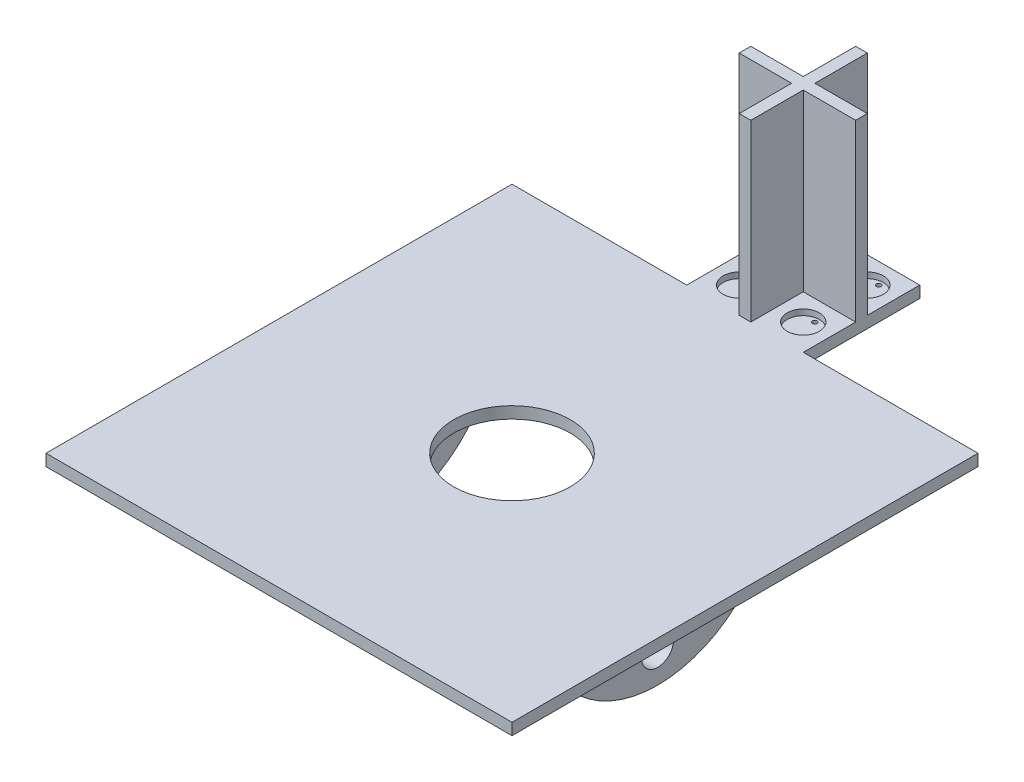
ISO-10303-21;
HEADER;
FILE_DESCRIPTION(('STEP AP214'),'2;1');
FILE_NAME('part.step','',(''),(''),'','','');
FILE_SCHEMA(('AUTOMOTIVE_DESIGN { 1 0 10303 214 1 1 1 1 }'));
ENDSEC;
DATA;
#1=APPLICATION_CONTEXT('core data for automotive mechanical design processes');
#2=APPLICATION_PROTOCOL_DEFINITION('international standard','automotive_design',2000,#1);
#3=PRODUCT_CONTEXT('',#1,'mechanical');
#4=PRODUCT('Part','Part','',(#3));
#5=PRODUCT_RELATED_PRODUCT_CATEGORY('part','',(#4));
#6=PRODUCT_DEFINITION_FORMATION('','',#4);
#7=PRODUCT_DEFINITION_CONTEXT('part definition',#1,'design');
#8=PRODUCT_DEFINITION('design','',#6,#7);
#9=PRODUCT_DEFINITION_SHAPE('','',#8);
#10=(LENGTH_UNIT() NAMED_UNIT(*) SI_UNIT(.MILLI.,.METRE.));
#11=(NAMED_UNIT(*) PLANE_ANGLE_UNIT() SI_UNIT($,.RADIAN.));
#12=(NAMED_UNIT(*) SI_UNIT($,.STERADIAN.) SOLID_ANGLE_UNIT());
#13=UNCERTAINTY_MEASURE_WITH_UNIT(LENGTH_MEASURE(1.E-05),#10,'distance_accuracy_value','');
#14=(GEOMETRIC_REPRESENTATION_CONTEXT(3) GLOBAL_UNCERTAINTY_ASSIGNED_CONTEXT((#13)) GLOBAL_UNIT_ASSIGNED_CONTEXT((#10,
#11,#12)) REPRESENTATION_CONTEXT('',''));
#15=CARTESIAN_POINT('',(0.,0.,0.));
#16=DIRECTION('',(0.,0.,1.));
#17=DIRECTION('',(1.,0.,0.));
#18=AXIS2_PLACEMENT_3D('',#15,#16,#17);
#19=CARTESIAN_POINT('',(22.05,-25.4,-25.4));
#20=DIRECTION('',(-1.,0.,0.));
#21=DIRECTION('',(0.,0.,1.));
#22=AXIS2_PLACEMENT_3D('',#19,#20,#21);
#23=PLANE('',#22);
#24=CARTESIAN_POINT('',(22.05,-18.5233102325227,-50.8));
#25=DIRECTION('',(-1.,0.,0.));
#26=DIRECTION('',(0.,0.,1.));
#27=AXIS2_PLACEMENT_3D('',#24,#25,#26);
#28=CIRCLE('',#27,3.5);
#29=CARTESIAN_POINT('',(22.05,-18.5233102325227,-47.3));
#30=VERTEX_POINT('',#29);
#31=EDGE_CURVE('E1110',#30,#30,#28,.T.);
#32=ORIENTED_EDGE('',*,*,#31,.T.);
#33=EDGE_LOOP('',(#32));
#34=FACE_BOUND('',#33,.T.);
#35=CARTESIAN_POINT('',(22.05,0.,-50.8));
#36=DIRECTION('',(-1.,0.,0.));
#37=DIRECTION('',(0.,0.,1.));
#38=AXIS2_PLACEMENT_3D('',#35,#36,#37);
#39=CIRCLE('',#38,25.4);
#40=CARTESIAN_POINT('',(22.05,0.,-76.2));
#41=VERTEX_POINT('',#40);
#42=CARTESIAN_POINT('',(22.05,0.,-25.4));
#43=VERTEX_POINT('',#42);
#44=EDGE_CURVE('E313',#41,#43,#39,.T.);
#45=ORIENTED_EDGE('',*,*,#44,.F.);
#46=DIRECTION('',(0.,0.,1.));
#47=VECTOR('',#46,1.);
#48=CARTESIAN_POINT('',(22.05,0.,-25.4));
#49=LINE('',#48,#47);
#50=EDGE_CURVE('E306',#41,#43,#49,.T.);
#51=ORIENTED_EDGE('',*,*,#50,.T.);
#52=EDGE_LOOP('',(#45,#51));
#53=FACE_BOUND('',#52,.T.);
#54=ADVANCED_FACE('F125',(#34,#53),#23,.F.);
#55=CARTESIAN_POINT('',(19.05,-25.4,-25.4));
#56=DIRECTION('',(1.,0.,0.));
#57=DIRECTION('',(0.,0.,-1.));
#58=AXIS2_PLACEMENT_3D('',#55,#56,#57);
#59=PLANE('',#58);
#60=CARTESIAN_POINT('',(19.05,-18.5233102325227,-50.8));
#61=DIRECTION('',(1.,0.,0.));
#62=DIRECTION('',(0.,0.,-1.));
#63=AXIS2_PLACEMENT_3D('',#60,#61,#62);
#64=CIRCLE('',#63,3.5);
#65=CARTESIAN_POINT('',(19.05,-18.5233102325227,-54.3));
#66=VERTEX_POINT('',#65);
#67=EDGE_CURVE('E1106',#66,#66,#64,.T.);
#68=ORIENTED_EDGE('',*,*,#67,.T.);
#69=EDGE_LOOP('',(#68));
#70=FACE_BOUND('',#69,.T.);
#71=DIRECTION('',(0.,0.,-1.));
#72=VECTOR('',#71,1.);
#73=CARTESIAN_POINT('',(19.05,0.,-25.4));
#74=LINE('',#73,#72);
#75=CARTESIAN_POINT('',(19.05,0.,-25.4));
#76=VERTEX_POINT('',#75);
#77=CARTESIAN_POINT('',(19.05,0.,-76.2));
#78=VERTEX_POINT('',#77);
#79=EDGE_CURVE('E329',#76,#78,#74,.T.);
#80=ORIENTED_EDGE('',*,*,#79,.T.);
#81=CARTESIAN_POINT('',(19.05,0.,-50.8));
#82=DIRECTION('',(1.,0.,0.));
#83=DIRECTION('',(0.,0.,-1.));
#84=AXIS2_PLACEMENT_3D('',#81,#82,#83);
#85=CIRCLE('',#84,25.4);
#86=EDGE_CURVE('E295',#76,#78,#85,.T.);
#87=ORIENTED_EDGE('',*,*,#86,.F.);
#88=EDGE_LOOP('',(#80,#87));
#89=FACE_BOUND('',#88,.T.);
#90=ADVANCED_FACE('F635',(#70,#89),#59,.F.);
#91=CARTESIAN_POINT('',(82.55,-25.4,-25.4));
#92=DIRECTION('',(-1.,0.,0.));
#93=DIRECTION('',(0.,0.,1.));
#94=AXIS2_PLACEMENT_3D('',#91,#92,#93);
#95=PLANE('',#94);
#96=CARTESIAN_POINT('',(82.55,-7.5233102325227,-50.8));
#97=DIRECTION('',(1.,0.,0.));
#98=DIRECTION('',(0.,0.,-1.));
#99=AXIS2_PLACEMENT_3D('',#96,#97,#98);
#100=CIRCLE('',#99,0.749999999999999);
#101=CARTESIAN_POINT('',(82.55,-7.5233102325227,-51.55));
#102=VERTEX_POINT('',#101);
#103=EDGE_CURVE('E1098',#102,#102,#100,.T.);
#104=ORIENTED_EDGE('',*,*,#103,.F.);
#105=EDGE_LOOP('',(#104));
#106=FACE_BOUND('',#105,.T.);
#107=CARTESIAN_POINT('',(82.55,-18.5233102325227,-50.8));
#108=DIRECTION('',(-1.,0.,0.));
#109=DIRECTION('',(0.,0.,1.));
#110=AXIS2_PLACEMENT_3D('',#107,#108,#109);
#111=CIRCLE('',#110,3.5);
#112=CARTESIAN_POINT('',(82.55,-18.5233102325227,-47.3));
#113=VERTEX_POINT('',#112);
#114=EDGE_CURVE('E1102',#113,#113,#111,.T.);
#115=ORIENTED_EDGE('',*,*,#114,.T.);
#116=EDGE_LOOP('',(#115));
#117=FACE_BOUND('',#116,.T.);
#118=CARTESIAN_POINT('',(82.55,0.,-50.8));
#119=DIRECTION('',(-1.,0.,0.));
#120=DIRECTION('',(0.,0.,1.));
#121=AXIS2_PLACEMENT_3D('',#118,#119,#120);
#122=CIRCLE('',#121,25.4);
#123=CARTESIAN_POINT('',(82.55,0.,-76.2));
#124=VERTEX_POINT('',#123);
#125=CARTESIAN_POINT('',(82.55,0.,-25.4));
#126=VERTEX_POINT('',#125);
#127=EDGE_CURVE('E287',#124,#126,#122,.T.);
#128=ORIENTED_EDGE('',*,*,#127,.F.);
#129=DIRECTION('',(0.,0.,1.));
#130=VECTOR('',#129,1.);
#131=CARTESIAN_POINT('',(82.55,0.,-25.4));
#132=LINE('',#131,#130);
#133=EDGE_CURVE('E291',#124,#126,#132,.T.);
#134=ORIENTED_EDGE('',*,*,#133,.T.);
#135=EDGE_LOOP('',(#128,#134));
#136=FACE_BOUND('',#135,.T.);
#137=ADVANCED_FACE('F289',(#106,#117,#136),#95,.F.);
#138=CARTESIAN_POINT('',(79.55,-25.4,-25.4));
#139=DIRECTION('',(1.,0.,0.));
#140=DIRECTION('',(0.,0.,-1.));
#141=AXIS2_PLACEMENT_3D('',#138,#139,#140);
#142=PLANE('',#141);
#143=CARTESIAN_POINT('',(79.55,-7.5233102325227,-50.8));
#144=DIRECTION('',(1.,0.,0.));
#145=DIRECTION('',(0.,0.,-1.));
#146=AXIS2_PLACEMENT_3D('',#143,#144,#145);
#147=CIRCLE('',#146,0.749999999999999);
#148=CARTESIAN_POINT('',(79.55,-7.5233102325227,-51.55));
#149=VERTEX_POINT('',#148);
#150=EDGE_CURVE('E1088',#149,#149,#147,.F.);
#151=ORIENTED_EDGE('',*,*,#150,.F.);
#152=EDGE_LOOP('',(#151));
#153=FACE_BOUND('',#152,.T.);
#154=CARTESIAN_POINT('',(79.55,-18.5233102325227,-50.8));
#155=DIRECTION('',(1.,0.,0.));
#156=DIRECTION('',(0.,0.,-1.));
#157=AXIS2_PLACEMENT_3D('',#154,#155,#156);
#158=CIRCLE('',#157,3.5);
#159=CARTESIAN_POINT('',(79.55,-18.5233102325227,-54.3));
#160=VERTEX_POINT('',#159);
#161=EDGE_CURVE('E129',#160,#160,#158,.T.);
#162=ORIENTED_EDGE('',*,*,#161,.T.);
#163=EDGE_LOOP('',(#162));
#164=FACE_BOUND('',#163,.T.);
#165=DIRECTION('',(0.,0.,-1.));
#166=VECTOR('',#165,1.);
#167=CARTESIAN_POINT('',(79.55,0.,-25.4));
#168=LINE('',#167,#166);
#169=CARTESIAN_POINT('',(79.55,0.,-25.4));
#170=VERTEX_POINT('',#169);
#171=CARTESIAN_POINT('',(79.55,0.,-76.2));
#172=VERTEX_POINT('',#171);
#173=EDGE_CURVE('E307',#170,#172,#168,.T.);
#174=ORIENTED_EDGE('',*,*,#173,.T.);
#175=CARTESIAN_POINT('',(79.55,0.,-50.8));
#176=DIRECTION('',(1.,0.,0.));
#177=DIRECTION('',(0.,0.,-1.));
#178=AXIS2_PLACEMENT_3D('',#175,#176,#177);
#179=CIRCLE('',#178,25.4);
#180=EDGE_CURVE('E296',#170,#172,#179,.T.);
#181=ORIENTED_EDGE('',*,*,#180,.F.);
#182=EDGE_LOOP('',(#174,#181));
#183=FACE_BOUND('',#182,.T.);
#184=ADVANCED_FACE('F678',(#153,#164,#183),#142,.F.);
#185=CARTESIAN_POINT('',(0.,0.,0.));
#186=DIRECTION('',(0.,-1.,0.));
#187=DIRECTION('',(0.,0.,-1.));
#188=AXIS2_PLACEMENT_3D('',#185,#186,#187);
#189=PLANE('',#188);
#190=CARTESIAN_POINT('',(43.815,0.,-104.815));
#191=DIRECTION('',(0.,1.,0.));
#192=DIRECTION('',(0.,0.,1.));
#193=AXIS2_PLACEMENT_3D('',#190,#191,#192);
#194=CIRCLE('',#193,0.499999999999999);
#195=CARTESIAN_POINT('',(43.815,0.,-104.315));
#196=VERTEX_POINT('',#195);
#197=EDGE_CURVE('E1189',#196,#196,#194,.T.);
#198=ORIENTED_EDGE('',*,*,#197,.T.);
#199=EDGE_LOOP('',(#198));
#200=FACE_BOUND('',#199,.T.);
#201=CARTESIAN_POINT('',(43.815,0.,-109.815));
#202=DIRECTION('',(0.,1.,0.));
#203=DIRECTION('',(0.,0.,1.));
#204=AXIS2_PLACEMENT_3D('',#201,#202,#203);
#205=CIRCLE('',#204,0.499999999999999);
#206=CARTESIAN_POINT('',(43.815,0.,-109.315));
#207=VERTEX_POINT('',#206);
#208=EDGE_CURVE('E1181',#207,#207,#205,.T.);
#209=ORIENTED_EDGE('',*,*,#208,.T.);
#210=EDGE_LOOP('',(#209));
#211=FACE_BOUND('',#210,.T.);
#212=CARTESIAN_POINT('',(57.785,0.,-109.815));
#213=DIRECTION('',(0.,1.,0.));
#214=DIRECTION('',(0.,0.,1.));
#215=AXIS2_PLACEMENT_3D('',#212,#213,#214);
#216=CIRCLE('',#215,0.499999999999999);
#217=CARTESIAN_POINT('',(57.785,0.,-109.315));
#218=VERTEX_POINT('',#217);
#219=EDGE_CURVE('E1173',#218,#218,#216,.T.);
#220=ORIENTED_EDGE('',*,*,#219,.T.);
#221=EDGE_LOOP('',(#220));
#222=FACE_BOUND('',#221,.T.);
#223=CARTESIAN_POINT('',(57.785,0.,-118.785));
#224=DIRECTION('',(0.,1.,0.));
#225=DIRECTION('',(0.,0.,1.));
#226=AXIS2_PLACEMENT_3D('',#223,#224,#225);
#227=CIRCLE('',#226,0.499999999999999);
#228=CARTESIAN_POINT('',(57.785,0.,-118.285));
#229=VERTEX_POINT('',#228);
#230=EDGE_CURVE('E1164',#229,#229,#227,.T.);
#231=ORIENTED_EDGE('',*,*,#230,.T.);
#232=EDGE_LOOP('',(#231));
#233=FACE_BOUND('',#232,.T.);
#234=CARTESIAN_POINT('',(57.785,0.,-123.785));
#235=DIRECTION('',(0.,1.,0.));
#236=DIRECTION('',(0.,0.,1.));
#237=AXIS2_PLACEMENT_3D('',#234,#235,#236);
#238=CIRCLE('',#237,0.499999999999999);
#239=CARTESIAN_POINT('',(57.785,0.,-123.285));
#240=VERTEX_POINT('',#239);
#241=EDGE_CURVE('E1212',#240,#240,#238,.T.);
#242=ORIENTED_EDGE('',*,*,#241,.T.);
#243=EDGE_LOOP('',(#242));
#244=FACE_BOUND('',#243,.T.);
#245=CARTESIAN_POINT('',(43.815,0.,-123.785));
#246=DIRECTION('',(0.,1.,0.));
#247=DIRECTION('',(0.,0.,1.));
#248=AXIS2_PLACEMENT_3D('',#245,#246,#247);
#249=CIRCLE('',#248,0.499999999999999);
#250=CARTESIAN_POINT('',(43.815,0.,-123.285));
#251=VERTEX_POINT('',#250);
#252=EDGE_CURVE('E1204',#251,#251,#249,.T.);
#253=ORIENTED_EDGE('',*,*,#252,.T.);
#254=EDGE_LOOP('',(#253));
#255=FACE_BOUND('',#254,.T.);
#256=CARTESIAN_POINT('',(57.785,0.,-104.815));
#257=DIRECTION('',(0.,1.,0.));
#258=DIRECTION('',(0.,0.,1.));
#259=AXIS2_PLACEMENT_3D('',#256,#257,#258);
#260=CIRCLE('',#259,0.499999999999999);
#261=CARTESIAN_POINT('',(57.785,0.,-104.315));
#262=VERTEX_POINT('',#261);
#263=EDGE_CURVE('E1196',#262,#262,#260,.T.);
#264=ORIENTED_EDGE('',*,*,#263,.T.);
#265=EDGE_LOOP('',(#264));
#266=FACE_BOUND('',#265,.T.);
#267=CARTESIAN_POINT('',(43.815,0.,-118.785));
#268=DIRECTION('',(0.,1.,0.));
#269=DIRECTION('',(0.,0.,1.));
#270=AXIS2_PLACEMENT_3D('',#267,#268,#269);
#271=CIRCLE('',#270,0.499999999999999);
#272=CARTESIAN_POINT('',(43.815,0.,-118.285));
#273=VERTEX_POINT('',#272);
#274=EDGE_CURVE('E1141',#273,#273,#271,.T.);
#275=ORIENTED_EDGE('',*,*,#274,.T.);
#276=EDGE_LOOP('',(#275));
#277=FACE_BOUND('',#276,.T.);
#278=DIRECTION('',(1.,0.,0.));
#279=VECTOR('',#278,1.);
#280=CARTESIAN_POINT('',(22.05,0.,-76.2));
#281=LINE('',#280,#279);
#282=EDGE_CURVE('E333',#78,#41,#281,.T.);
#283=ORIENTED_EDGE('',*,*,#282,.F.);
#284=ORIENTED_EDGE('',*,*,#79,.F.);
#285=DIRECTION('',(-1.,0.,0.));
#286=VECTOR('',#285,1.);
#287=CARTESIAN_POINT('',(22.05,0.,-25.4));
#288=LINE('',#287,#286);
#289=EDGE_CURVE('E326',#43,#76,#288,.T.);
#290=ORIENTED_EDGE('',*,*,#289,.F.);
#291=ORIENTED_EDGE('',*,*,#50,.F.);
#292=EDGE_LOOP('',(#283,#284,#290,#291));
#293=FACE_BOUND('',#292,.T.);
#294=DIRECTION('',(1.,0.,0.));
#295=VECTOR('',#294,1.);
#296=CARTESIAN_POINT('',(82.55,0.,-76.2));
#297=LINE('',#296,#295);
#298=EDGE_CURVE('E299',#172,#124,#297,.T.);
#299=ORIENTED_EDGE('',*,*,#298,.F.);
#300=ORIENTED_EDGE('',*,*,#173,.F.);
#301=DIRECTION('',(-1.,0.,0.));
#302=VECTOR('',#301,1.);
#303=CARTESIAN_POINT('',(82.55,0.,-25.4));
#304=LINE('',#303,#302);
#305=EDGE_CURVE('E311',#126,#170,#304,.T.);
#306=ORIENTED_EDGE('',*,*,#305,.F.);
#307=ORIENTED_EDGE('',*,*,#133,.F.);
#308=EDGE_LOOP('',(#299,#300,#306,#307));
#309=FACE_BOUND('',#308,.T.);
#310=DIRECTION('',(1.,0.,0.));
#311=VECTOR('',#310,1.);
#312=CARTESIAN_POINT('',(0.,0.,0.));
#313=LINE('',#312,#311);
#314=CARTESIAN_POINT('',(0.,0.,0.));
#315=VERTEX_POINT('',#314);
#316=CARTESIAN_POINT('',(101.6,0.,0.));
#317=VERTEX_POINT('',#316);
#318=EDGE_CURVE('E493',#315,#317,#313,.T.);
#319=ORIENTED_EDGE('',*,*,#318,.F.);
#320=DIRECTION('',(0.,0.,1.));
#321=VECTOR('',#320,1.);
#322=CARTESIAN_POINT('',(0.,0.,0.));
#323=LINE('',#322,#321);
#324=CARTESIAN_POINT('',(0.,0.,-101.6));
#325=VERTEX_POINT('',#324);
#326=EDGE_CURVE('E457',#325,#315,#323,.T.);
#327=ORIENTED_EDGE('',*,*,#326,.F.);
#328=DIRECTION('',(-1.,0.,0.));
#329=VECTOR('',#328,1.);
#330=CARTESIAN_POINT('',(0.,0.,-101.6));
#331=LINE('',#330,#329);
#332=CARTESIAN_POINT('',(38.1,0.,-101.6));
#333=VERTEX_POINT('',#332);
#334=EDGE_CURVE('E466',#333,#325,#331,.T.);
#335=ORIENTED_EDGE('',*,*,#334,.F.);
#336=DIRECTION('',(0.,0.,1.));
#337=VECTOR('',#336,1.);
#338=CARTESIAN_POINT('',(38.1,0.,-101.6));
#339=LINE('',#338,#337);
#340=CARTESIAN_POINT('',(38.1,0.,-127.));
#341=VERTEX_POINT('',#340);
#342=EDGE_CURVE('E508',#341,#333,#339,.T.);
#343=ORIENTED_EDGE('',*,*,#342,.F.);
#344=DIRECTION('',(-1.,0.,0.));
#345=VECTOR('',#344,1.);
#346=CARTESIAN_POINT('',(38.1,0.,-127.));
#347=LINE('',#346,#345);
#348=CARTESIAN_POINT('',(63.5,0.,-127.));
#349=VERTEX_POINT('',#348);
#350=EDGE_CURVE('E505',#349,#341,#347,.T.);
#351=ORIENTED_EDGE('',*,*,#350,.F.);
#352=DIRECTION('',(0.,0.,-1.));
#353=VECTOR('',#352,1.);
#354=CARTESIAN_POINT('',(63.5,0.,-101.6));
#355=LINE('',#354,#353);
#356=CARTESIAN_POINT('',(63.5,0.,-101.6));
#357=VERTEX_POINT('',#356);
#358=EDGE_CURVE('E502',#357,#349,#355,.T.);
#359=ORIENTED_EDGE('',*,*,#358,.F.);
#360=DIRECTION('',(-1.,0.,0.));
#361=VECTOR('',#360,1.);
#362=CARTESIAN_POINT('',(63.5,0.,-101.6));
#363=LINE('',#362,#361);
#364=CARTESIAN_POINT('',(101.6,0.,-101.6));
#365=VERTEX_POINT('',#364);
#366=EDGE_CURVE('E499',#365,#357,#363,.T.);
#367=ORIENTED_EDGE('',*,*,#366,.F.);
#368=DIRECTION('',(0.,0.,-1.));
#369=VECTOR('',#368,1.);
#370=CARTESIAN_POINT('',(101.6,0.,0.));
#371=LINE('',#370,#369);
#372=EDGE_CURVE('E496',#317,#365,#371,.T.);
#373=ORIENTED_EDGE('',*,*,#372,.F.);
#374=EDGE_LOOP('',(#319,#327,#335,#343,#351,#359,#367,#373));
#375=FACE_BOUND('',#374,.T.);
#376=CARTESIAN_POINT('',(50.8,0.,-50.8));
#377=DIRECTION('',(0.,1.,0.));
#378=DIRECTION('',(0.,0.,1.));
#379=AXIS2_PLACEMENT_3D('',#376,#377,#378);
#380=CIRCLE('',#379,12.7);
#381=CARTESIAN_POINT('',(50.8,0.,-38.1));
#382=VERTEX_POINT('',#381);
#383=EDGE_CURVE('E452',#382,#382,#380,.T.);
#384=ORIENTED_EDGE('',*,*,#383,.T.);
#385=EDGE_LOOP('',(#384));
#386=FACE_BOUND('',#385,.T.);
#387=ADVANCED_FACE('F309',(#200,#211,#222,#233,#244,#255,#266,#277,#293,#309,#375,#386),#189,.T.);
#388=CARTESIAN_POINT('',(0.,2.54,0.));
#389=DIRECTION('',(0.,-1.,0.));
#390=DIRECTION('',(0.,0.,-1.));
#391=AXIS2_PLACEMENT_3D('',#388,#389,#390);
#392=PLANE('',#391);
#393=CARTESIAN_POINT('',(57.785,2.54,-121.285));
#394=DIRECTION('',(0.,1.,0.));
#395=DIRECTION('',(0.,0.,1.));
#396=AXIS2_PLACEMENT_3D('',#393,#394,#395);
#397=CIRCLE('',#396,3.5);
#398=CARTESIAN_POINT('',(57.785,2.54,-117.785));
#399=VERTEX_POINT('',#398);
#400=EDGE_CURVE('E1136',#399,#399,#397,.T.);
#401=ORIENTED_EDGE('',*,*,#400,.F.);
#402=EDGE_LOOP('',(#401));
#403=FACE_BOUND('',#402,.T.);
#404=DIRECTION('',(0.,0.,-1.));
#405=VECTOR('',#404,1.);
#406=CARTESIAN_POINT('',(52.07,2.54,-127.));
#407=LINE('',#406,#405);
#408=CARTESIAN_POINT('',(52.07,2.54,-115.57));
#409=VERTEX_POINT('',#408);
#410=CARTESIAN_POINT('',(52.07,2.54,-127.));
#411=VERTEX_POINT('',#410);
#412=EDGE_CURVE('E142',#409,#411,#407,.T.);
#413=ORIENTED_EDGE('',*,*,#412,.F.);
#414=DIRECTION('',(-1.,0.,0.));
#415=VECTOR('',#414,1.);
#416=CARTESIAN_POINT('',(52.07,2.54,-115.57));
#417=LINE('',#416,#415);
#418=CARTESIAN_POINT('',(63.5,2.54,-115.57));
#419=VERTEX_POINT('',#418);
#420=EDGE_CURVE('E400',#419,#409,#417,.T.);
#421=ORIENTED_EDGE('',*,*,#420,.F.);
#422=DIRECTION('',(0.,0.,-1.));
#423=VECTOR('',#422,1.);
#424=CARTESIAN_POINT('',(63.5,2.54,-101.6));
#425=LINE('',#424,#423);
#426=CARTESIAN_POINT('',(63.5,2.54,-127.));
#427=VERTEX_POINT('',#426);
#428=EDGE_CURVE('E475',#419,#427,#425,.T.);
#429=ORIENTED_EDGE('',*,*,#428,.T.);
#430=DIRECTION('',(-1.,0.,0.));
#431=VECTOR('',#430,1.);
#432=CARTESIAN_POINT('',(38.1,2.54,-127.));
#433=LINE('',#432,#431);
#434=EDGE_CURVE('E480',#427,#411,#433,.T.);
#435=ORIENTED_EDGE('',*,*,#434,.T.);
#436=EDGE_LOOP('',(#413,#421,#429,#435));
#437=FACE_BOUND('',#436,.T.);
#438=ADVANCED_FACE('F592',(#403,#437),#392,.F.);
#439=CARTESIAN_POINT('',(57.785,2.54,-107.315));
#440=DIRECTION('',(0.,1.,0.));
#441=DIRECTION('',(0.,0.,1.));
#442=AXIS2_PLACEMENT_3D('',#439,#440,#441);
#443=CIRCLE('',#442,3.5);
#444=CARTESIAN_POINT('',(57.785,2.54,-103.815));
#445=VERTEX_POINT('',#444);
#446=EDGE_CURVE('E1145',#445,#445,#443,.T.);
#447=ORIENTED_EDGE('',*,*,#446,.F.);
#448=EDGE_LOOP('',(#447));
#449=FACE_BOUND('',#448,.T.);
#450=CARTESIAN_POINT('',(43.815,2.54,-107.315));
#451=DIRECTION('',(0.,1.,0.));
#452=DIRECTION('',(0.,0.,1.));
#453=AXIS2_PLACEMENT_3D('',#450,#451,#452);
#454=CIRCLE('',#453,3.5);
#455=CARTESIAN_POINT('',(43.815,2.54,-103.815));
#456=VERTEX_POINT('',#455);
#457=EDGE_CURVE('E1091',#456,#456,#454,.T.);
#458=ORIENTED_EDGE('',*,*,#457,.F.);
#459=EDGE_LOOP('',(#458));
#460=FACE_BOUND('',#459,.T.);
#461=CARTESIAN_POINT('',(50.8,2.54,-50.8));
#462=DIRECTION('',(0.,1.,0.));
#463=DIRECTION('',(0.,0.,1.));
#464=AXIS2_PLACEMENT_3D('',#461,#462,#463);
#465=CIRCLE('',#464,12.7);
#466=CARTESIAN_POINT('',(50.8,2.54,-38.1));
#467=VERTEX_POINT('',#466);
#468=EDGE_CURVE('E453',#467,#467,#465,.T.);
#469=ORIENTED_EDGE('',*,*,#468,.F.);
#470=EDGE_LOOP('',(#469));
#471=FACE_BOUND('',#470,.T.);
#472=DIRECTION('',(1.,0.,0.));
#473=VECTOR('',#472,1.);
#474=CARTESIAN_POINT('',(63.5,2.54,-113.03));
#475=LINE('',#474,#473);
#476=CARTESIAN_POINT('',(52.07,2.54,-113.03));
#477=VERTEX_POINT('',#476);
#478=CARTESIAN_POINT('',(63.5,2.54,-113.03));
#479=VERTEX_POINT('',#478);
#480=EDGE_CURVE('E150',#477,#479,#475,.T.);
#481=ORIENTED_EDGE('',*,*,#480,.F.);
#482=DIRECTION('',(0.,0.,-1.));
#483=VECTOR('',#482,1.);
#484=CARTESIAN_POINT('',(52.07,2.54,-113.03));
#485=LINE('',#484,#483);
#486=CARTESIAN_POINT('',(52.0700000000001,2.54,-101.6));
#487=VERTEX_POINT('',#486);
#488=EDGE_CURVE('E395',#487,#477,#485,.T.);
#489=ORIENTED_EDGE('',*,*,#488,.F.);
#490=DIRECTION('',(1.,0.,0.));
#491=VECTOR('',#490,1.);
#492=CARTESIAN_POINT('',(52.0700000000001,2.54,-101.6));
#493=LINE('',#492,#491);
#494=CARTESIAN_POINT('',(49.53,2.54,-101.6));
#495=VERTEX_POINT('',#494);
#496=EDGE_CURVE('E391',#495,#487,#493,.T.);
#497=ORIENTED_EDGE('',*,*,#496,.F.);
#498=DIRECTION('',(0.,0.,1.));
#499=VECTOR('',#498,1.);
#500=CARTESIAN_POINT('',(49.53,2.54,-101.6));
#501=LINE('',#500,#499);
#502=CARTESIAN_POINT('',(49.53,2.54,-113.03));
#503=VERTEX_POINT('',#502);
#504=EDGE_CURVE('E387',#503,#495,#501,.T.);
#505=ORIENTED_EDGE('',*,*,#504,.F.);
#506=DIRECTION('',(1.,0.,0.));
#507=VECTOR('',#506,1.);
#508=CARTESIAN_POINT('',(49.53,2.54,-113.03));
#509=LINE('',#508,#507);
#510=CARTESIAN_POINT('',(38.1,2.54,-113.03));
#511=VERTEX_POINT('',#510);
#512=EDGE_CURVE('E383',#511,#503,#509,.T.);
#513=ORIENTED_EDGE('',*,*,#512,.F.);
#514=DIRECTION('',(0.,0.,1.));
#515=VECTOR('',#514,1.);
#516=CARTESIAN_POINT('',(38.1,2.54,-101.6));
#517=LINE('',#516,#515);
#518=CARTESIAN_POINT('',(38.1,2.54,-101.6));
#519=VERTEX_POINT('',#518);
#520=EDGE_CURVE('E483',#511,#519,#517,.T.);
#521=ORIENTED_EDGE('',*,*,#520,.T.);
#522=DIRECTION('',(-1.,0.,0.));
#523=VECTOR('',#522,1.);
#524=CARTESIAN_POINT('',(0.,2.54,-101.6));
#525=LINE('',#524,#523);
#526=CARTESIAN_POINT('',(0.,2.54,-101.6));
#527=VERTEX_POINT('',#526);
#528=EDGE_CURVE('E487',#519,#527,#525,.T.);
#529=ORIENTED_EDGE('',*,*,#528,.T.);
#530=DIRECTION('',(0.,0.,1.));
#531=VECTOR('',#530,1.);
#532=CARTESIAN_POINT('',(0.,2.54,0.));
#533=LINE('',#532,#531);
#534=CARTESIAN_POINT('',(0.,2.54,0.));
#535=VERTEX_POINT('',#534);
#536=EDGE_CURVE('E461',#527,#535,#533,.T.);
#537=ORIENTED_EDGE('',*,*,#536,.T.);
#538=DIRECTION('',(1.,0.,0.));
#539=VECTOR('',#538,1.);
#540=CARTESIAN_POINT('',(0.,2.54,0.));
#541=LINE('',#540,#539);
#542=CARTESIAN_POINT('',(101.6,2.54,0.));
#543=VERTEX_POINT('',#542);
#544=EDGE_CURVE('E465',#535,#543,#541,.T.);
#545=ORIENTED_EDGE('',*,*,#544,.T.);
#546=DIRECTION('',(0.,0.,-1.));
#547=VECTOR('',#546,1.);
#548=CARTESIAN_POINT('',(101.6,2.54,0.));
#549=LINE('',#548,#547);
#550=CARTESIAN_POINT('',(101.6,2.54,-101.6));
#551=VERTEX_POINT('',#550);
#552=EDGE_CURVE('E469',#543,#551,#549,.T.);
#553=ORIENTED_EDGE('',*,*,#552,.T.);
#554=DIRECTION('',(-1.,0.,0.));
#555=VECTOR('',#554,1.);
#556=CARTESIAN_POINT('',(63.5,2.54,-101.6));
#557=LINE('',#556,#555);
#558=CARTESIAN_POINT('',(63.5,2.54,-101.6));
#559=VERTEX_POINT('',#558);
#560=EDGE_CURVE('E472',#551,#559,#557,.T.);
#561=ORIENTED_EDGE('',*,*,#560,.T.);
#562=EDGE_CURVE('E476',#559,#479,#425,.T.);
#563=ORIENTED_EDGE('',*,*,#562,.T.);
#564=EDGE_LOOP('',(#481,#489,#497,#505,#513,#521,#529,#537,#545,#553,#561,#563));
#565=FACE_BOUND('',#564,.T.);
#566=ADVANCED_FACE('F561',(#449,#460,#471,#565),#392,.F.);
#567=CARTESIAN_POINT('',(43.815,2.54,-121.285));
#568=DIRECTION('',(0.,1.,0.));
#569=DIRECTION('',(0.,0.,1.));
#570=AXIS2_PLACEMENT_3D('',#567,#568,#569);
#571=CIRCLE('',#570,3.5);
#572=CARTESIAN_POINT('',(43.815,2.54,-117.785));
#573=VERTEX_POINT('',#572);
#574=EDGE_CURVE('E1079',#573,#573,#571,.T.);
#575=ORIENTED_EDGE('',*,*,#574,.F.);
#576=EDGE_LOOP('',(#575));
#577=FACE_BOUND('',#576,.T.);
#578=DIRECTION('',(0.,0.,1.));
#579=VECTOR('',#578,1.);
#580=CARTESIAN_POINT('',(49.53,2.54,-115.57));
#581=LINE('',#580,#579);
#582=CARTESIAN_POINT('',(49.53,2.54,-127.));
#583=VERTEX_POINT('',#582);
#584=CARTESIAN_POINT('',(49.53,2.54,-115.57));
#585=VERTEX_POINT('',#584);
#586=EDGE_CURVE('E337',#583,#585,#581,.T.);
#587=ORIENTED_EDGE('',*,*,#586,.F.);
#588=CARTESIAN_POINT('',(38.1,2.54,-127.));
#589=VERTEX_POINT('',#588);
#590=EDGE_CURVE('E479',#583,#589,#433,.T.);
#591=ORIENTED_EDGE('',*,*,#590,.T.);
#592=CARTESIAN_POINT('',(38.1,2.54,-115.57));
#593=VERTEX_POINT('',#592);
#594=EDGE_CURVE('E484',#589,#593,#517,.T.);
#595=ORIENTED_EDGE('',*,*,#594,.T.);
#596=DIRECTION('',(-1.,0.,0.));
#597=VECTOR('',#596,1.);
#598=CARTESIAN_POINT('',(38.1,2.54,-115.57));
#599=LINE('',#598,#597);
#600=EDGE_CURVE('E379',#585,#593,#599,.T.);
#601=ORIENTED_EDGE('',*,*,#600,.F.);
#602=EDGE_LOOP('',(#587,#591,#595,#601));
#603=FACE_BOUND('',#602,.T.);
#604=ADVANCED_FACE('F618',(#577,#603),#392,.F.);
#605=CARTESIAN_POINT('',(0.,2.54,0.));
#606=DIRECTION('',(1.,0.,0.));
#607=DIRECTION('',(0.,0.,-1.));
#608=AXIS2_PLACEMENT_3D('',#605,#606,#607);
#609=PLANE('',#608);
#610=ORIENTED_EDGE('',*,*,#326,.T.);
#611=DIRECTION('',(0.,-1.,0.));
#612=VECTOR('',#611,1.);
#613=CARTESIAN_POINT('',(0.,2.54,0.));
#614=LINE('',#613,#612);
#615=EDGE_CURVE('E12',#535,#315,#614,.T.);
#616=ORIENTED_EDGE('',*,*,#615,.F.);
#617=ORIENTED_EDGE('',*,*,#536,.F.);
#618=DIRECTION('',(0.,-1.,0.));
#619=VECTOR('',#618,1.);
#620=CARTESIAN_POINT('',(0.,2.54,-101.6));
#621=LINE('',#620,#619);
#622=EDGE_CURVE('E490',#527,#325,#621,.T.);
#623=ORIENTED_EDGE('',*,*,#622,.T.);
#624=EDGE_LOOP('',(#610,#616,#617,#623));
#625=FACE_BOUND('',#624,.T.);
#626=ADVANCED_FACE('F127',(#625),#609,.F.);
#627=CARTESIAN_POINT('',(0.,2.54,0.));
#628=DIRECTION('',(0.,0.,-1.));
#629=DIRECTION('',(-1.,0.,0.));
#630=AXIS2_PLACEMENT_3D('',#627,#628,#629);
#631=PLANE('',#630);
#632=ORIENTED_EDGE('',*,*,#318,.T.);
#633=DIRECTION('',(0.,-1.,0.));
#634=VECTOR('',#633,1.);
#635=CARTESIAN_POINT('',(101.6,2.54,0.));
#636=LINE('',#635,#634);
#637=EDGE_CURVE('E135',#543,#317,#636,.T.);
#638=ORIENTED_EDGE('',*,*,#637,.F.);
#639=ORIENTED_EDGE('',*,*,#544,.F.);
#640=ORIENTED_EDGE('',*,*,#615,.T.);
#641=EDGE_LOOP('',(#632,#638,#639,#640));
#642=FACE_BOUND('',#641,.T.);
#643=ADVANCED_FACE('F627',(#642),#631,.F.);
#644=CARTESIAN_POINT('',(101.6,2.54,0.));
#645=DIRECTION('',(-1.,0.,0.));
#646=DIRECTION('',(0.,0.,1.));
#647=AXIS2_PLACEMENT_3D('',#644,#645,#646);
#648=PLANE('',#647);
#649=ORIENTED_EDGE('',*,*,#372,.T.);
#650=DIRECTION('',(0.,-1.,0.));
#651=VECTOR('',#650,1.);
#652=CARTESIAN_POINT('',(101.6,2.54,-101.6));
#653=LINE('',#652,#651);
#654=EDGE_CURVE('E532',#551,#365,#653,.T.);
#655=ORIENTED_EDGE('',*,*,#654,.F.);
#656=ORIENTED_EDGE('',*,*,#552,.F.);
#657=ORIENTED_EDGE('',*,*,#637,.T.);
#658=EDGE_LOOP('',(#649,#655,#656,#657));
#659=FACE_BOUND('',#658,.T.);
#660=ADVANCED_FACE('F542',(#659),#648,.F.);
#661=CARTESIAN_POINT('',(63.5,2.54,-101.6));
#662=DIRECTION('',(0.,0.,1.));
#663=DIRECTION('',(1.,0.,0.));
#664=AXIS2_PLACEMENT_3D('',#661,#662,#663);
#665=PLANE('',#664);
#666=ORIENTED_EDGE('',*,*,#366,.T.);
#667=DIRECTION('',(0.,-1.,0.));
#668=VECTOR('',#667,1.);
#669=CARTESIAN_POINT('',(63.5,2.54,-101.6));
#670=LINE('',#669,#668);
#671=EDGE_CURVE('E528',#559,#357,#670,.T.);
#672=ORIENTED_EDGE('',*,*,#671,.F.);
#673=ORIENTED_EDGE('',*,*,#560,.F.);
#674=ORIENTED_EDGE('',*,*,#654,.T.);
#675=EDGE_LOOP('',(#666,#672,#673,#674));
#676=FACE_BOUND('',#675,.T.);
#677=ADVANCED_FACE('F553',(#676),#665,.F.);
#678=CARTESIAN_POINT('',(63.5,2.54,-101.6));
#679=DIRECTION('',(-1.,0.,0.));
#680=DIRECTION('',(0.,0.,1.));
#681=AXIS2_PLACEMENT_3D('',#678,#679,#680);
#682=PLANE('',#681);
#683=ORIENTED_EDGE('',*,*,#358,.T.);
#684=DIRECTION('',(0.,-1.,0.));
#685=VECTOR('',#684,1.);
#686=CARTESIAN_POINT('',(63.5,2.54,-127.));
#687=LINE('',#686,#685);
#688=EDGE_CURVE('E524',#427,#349,#687,.T.);
#689=ORIENTED_EDGE('',*,*,#688,.F.);
#690=ORIENTED_EDGE('',*,*,#428,.F.);
#691=DIRECTION('',(0.,-1.,0.));
#692=VECTOR('',#691,1.);
#693=CARTESIAN_POINT('',(63.5,40.64,-115.57));
#694=LINE('',#693,#692);
#695=CARTESIAN_POINT('',(63.5,40.64,-115.57));
#696=VERTEX_POINT('',#695);
#697=EDGE_CURVE('E416',#696,#419,#694,.T.);
#698=ORIENTED_EDGE('',*,*,#697,.F.);
#699=DIRECTION('',(0.,0.,-1.));
#700=VECTOR('',#699,1.);
#701=CARTESIAN_POINT('',(63.5,40.64,-113.03));
#702=LINE('',#701,#700);
#703=CARTESIAN_POINT('',(63.5,40.64,-113.03));
#704=VERTEX_POINT('',#703);
#705=EDGE_CURVE('E363',#704,#696,#702,.T.);
#706=ORIENTED_EDGE('',*,*,#705,.F.);
#707=DIRECTION('',(0.,-1.,0.));
#708=VECTOR('',#707,1.);
#709=CARTESIAN_POINT('',(63.5,40.64,-113.03));
#710=LINE('',#709,#708);
#711=EDGE_CURVE('E420',#704,#479,#710,.T.);
#712=ORIENTED_EDGE('',*,*,#711,.T.);
#713=ORIENTED_EDGE('',*,*,#562,.F.);
#714=ORIENTED_EDGE('',*,*,#671,.T.);
#715=EDGE_LOOP('',(#683,#689,#690,#698,#706,#712,#713,#714));
#716=FACE_BOUND('',#715,.T.);
#717=ADVANCED_FACE('F557',(#716),#682,.F.);
#718=CARTESIAN_POINT('',(38.1,2.54,-127.));
#719=DIRECTION('',(0.,0.,1.));
#720=DIRECTION('',(1.,0.,0.));
#721=AXIS2_PLACEMENT_3D('',#718,#719,#720);
#722=PLANE('',#721);
#723=ORIENTED_EDGE('',*,*,#350,.T.);
#724=DIRECTION('',(0.,-1.,0.));
#725=VECTOR('',#724,1.);
#726=CARTESIAN_POINT('',(38.1,2.54,-127.));
#727=LINE('',#726,#725);
#728=EDGE_CURVE('E520',#589,#341,#727,.T.);
#729=ORIENTED_EDGE('',*,*,#728,.F.);
#730=ORIENTED_EDGE('',*,*,#590,.F.);
#731=DIRECTION('',(0.,-1.,0.));
#732=VECTOR('',#731,1.);
#733=CARTESIAN_POINT('',(49.53,40.64,-127.));
#734=LINE('',#733,#732);
#735=CARTESIAN_POINT('',(49.53,40.64,-127.));
#736=VERTEX_POINT('',#735);
#737=EDGE_CURVE('E375',#736,#583,#734,.T.);
#738=ORIENTED_EDGE('',*,*,#737,.F.);
#739=DIRECTION('',(-1.,0.,0.));
#740=VECTOR('',#739,1.);
#741=CARTESIAN_POINT('',(52.07,40.64,-127.));
#742=LINE('',#741,#740);
#743=CARTESIAN_POINT('',(52.07,40.64,-127.));
#744=VERTEX_POINT('',#743);
#745=EDGE_CURVE('E372',#744,#736,#742,.T.);
#746=ORIENTED_EDGE('',*,*,#745,.F.);
#747=DIRECTION('',(0.,-1.,0.));
#748=VECTOR('',#747,1.);
#749=CARTESIAN_POINT('',(52.07,40.64,-127.));
#750=LINE('',#749,#748);
#751=EDGE_CURVE('E408',#744,#411,#750,.T.);
#752=ORIENTED_EDGE('',*,*,#751,.T.);
#753=ORIENTED_EDGE('',*,*,#434,.F.);
#754=ORIENTED_EDGE('',*,*,#688,.T.);
#755=EDGE_LOOP('',(#723,#729,#730,#738,#746,#752,#753,#754));
#756=FACE_BOUND('',#755,.T.);
#757=ADVANCED_FACE('F596',(#756),#722,.F.);
#758=CARTESIAN_POINT('',(38.1,2.54,-101.6));
#759=DIRECTION('',(1.,0.,0.));
#760=DIRECTION('',(0.,0.,-1.));
#761=AXIS2_PLACEMENT_3D('',#758,#759,#760);
#762=PLANE('',#761);
#763=ORIENTED_EDGE('',*,*,#342,.T.);
#764=DIRECTION('',(0.,-1.,0.));
#765=VECTOR('',#764,1.);
#766=CARTESIAN_POINT('',(38.1,2.54,-101.6));
#767=LINE('',#766,#765);
#768=EDGE_CURVE('E516',#519,#333,#767,.T.);
#769=ORIENTED_EDGE('',*,*,#768,.F.);
#770=ORIENTED_EDGE('',*,*,#520,.F.);
#771=DIRECTION('',(0.,-1.,0.));
#772=VECTOR('',#771,1.);
#773=CARTESIAN_POINT('',(38.1,40.64,-113.03));
#774=LINE('',#773,#772);
#775=CARTESIAN_POINT('',(38.1,40.64,-113.03));
#776=VERTEX_POINT('',#775);
#777=EDGE_CURVE('E440',#776,#511,#774,.T.);
#778=ORIENTED_EDGE('',*,*,#777,.F.);
#779=DIRECTION('',(0.,0.,1.));
#780=VECTOR('',#779,1.);
#781=CARTESIAN_POINT('',(38.1,40.64,-113.03));
#782=LINE('',#781,#780);
#783=CARTESIAN_POINT('',(38.1,40.64,-115.57));
#784=VERTEX_POINT('',#783);
#785=EDGE_CURVE('E345',#784,#776,#782,.T.);
#786=ORIENTED_EDGE('',*,*,#785,.F.);
#787=DIRECTION('',(0.,-1.,0.));
#788=VECTOR('',#787,1.);
#789=CARTESIAN_POINT('',(38.1,40.64,-115.57));
#790=LINE('',#789,#788);
#791=EDGE_CURVE('E444',#784,#593,#790,.T.);
#792=ORIENTED_EDGE('',*,*,#791,.T.);
#793=ORIENTED_EDGE('',*,*,#594,.F.);
#794=ORIENTED_EDGE('',*,*,#728,.T.);
#795=EDGE_LOOP('',(#763,#769,#770,#778,#786,#792,#793,#794));
#796=FACE_BOUND('',#795,.T.);
#797=ADVANCED_FACE('F585',(#796),#762,.F.);
#798=CARTESIAN_POINT('',(0.,2.54,-101.6));
#799=DIRECTION('',(0.,0.,1.));
#800=DIRECTION('',(1.,0.,0.));
#801=AXIS2_PLACEMENT_3D('',#798,#799,#800);
#802=PLANE('',#801);
#803=ORIENTED_EDGE('',*,*,#334,.T.);
#804=ORIENTED_EDGE('',*,*,#622,.F.);
#805=ORIENTED_EDGE('',*,*,#528,.F.);
#806=ORIENTED_EDGE('',*,*,#768,.T.);
#807=EDGE_LOOP('',(#803,#804,#805,#806));
#808=FACE_BOUND('',#807,.T.);
#809=ADVANCED_FACE('F622',(#808),#802,.F.);
#810=CARTESIAN_POINT('',(50.8,2.54,-50.8));
#811=DIRECTION('',(0.,-1.,0.));
#812=DIRECTION('',(0.,0.,-1.));
#813=AXIS2_PLACEMENT_3D('',#810,#811,#812);
#814=CYLINDRICAL_SURFACE('',#813,12.7);
#815=ORIENTED_EDGE('',*,*,#468,.T.);
#816=EDGE_LOOP('',(#815));
#817=FACE_BOUND('',#816,.T.);
#818=ORIENTED_EDGE('',*,*,#383,.F.);
#819=EDGE_LOOP('',(#818));
#820=FACE_BOUND('',#819,.T.);
#821=ADVANCED_FACE('F668',(#817,#820),#814,.F.);
#822=CARTESIAN_POINT('',(49.53,40.64,-115.57));
#823=DIRECTION('',(1.,0.,0.));
#824=DIRECTION('',(0.,0.,-1.));
#825=AXIS2_PLACEMENT_3D('',#822,#823,#824);
#826=PLANE('',#825);
#827=ORIENTED_EDGE('',*,*,#586,.T.);
#828=DIRECTION('',(0.,-1.,0.));
#829=VECTOR('',#828,1.);
#830=CARTESIAN_POINT('',(49.53,40.64,-115.57));
#831=LINE('',#830,#829);
#832=CARTESIAN_POINT('',(49.53,40.64,-115.57));
#833=VERTEX_POINT('',#832);
#834=EDGE_CURVE('E448',#833,#585,#831,.T.);
#835=ORIENTED_EDGE('',*,*,#834,.F.);
#836=DIRECTION('',(0.,0.,1.));
#837=VECTOR('',#836,1.);
#838=CARTESIAN_POINT('',(49.53,40.64,-115.57));
#839=LINE('',#838,#837);
#840=EDGE_CURVE('E338',#736,#833,#839,.T.);
#841=ORIENTED_EDGE('',*,*,#840,.F.);
#842=ORIENTED_EDGE('',*,*,#737,.T.);
#843=EDGE_LOOP('',(#827,#835,#841,#842));
#844=FACE_BOUND('',#843,.T.);
#845=ADVANCED_FACE('F665',(#844),#826,.F.);
#846=CARTESIAN_POINT('',(38.1,40.64,-115.57));
#847=DIRECTION('',(0.,0.,1.));
#848=DIRECTION('',(1.,0.,0.));
#849=AXIS2_PLACEMENT_3D('',#846,#847,#848);
#850=PLANE('',#849);
#851=ORIENTED_EDGE('',*,*,#600,.T.);
#852=ORIENTED_EDGE('',*,*,#791,.F.);
#853=DIRECTION('',(-1.,0.,0.));
#854=VECTOR('',#853,1.);
#855=CARTESIAN_POINT('',(38.1,40.64,-115.57));
#856=LINE('',#855,#854);
#857=EDGE_CURVE('E342',#833,#784,#856,.T.);
#858=ORIENTED_EDGE('',*,*,#857,.F.);
#859=ORIENTED_EDGE('',*,*,#834,.T.);
#860=EDGE_LOOP('',(#851,#852,#858,#859));
#861=FACE_BOUND('',#860,.T.);
#862=ADVANCED_FACE('F613',(#861),#850,.F.);
#863=CARTESIAN_POINT('',(49.53,40.64,-113.03));
#864=DIRECTION('',(0.,0.,-1.));
#865=DIRECTION('',(-1.,0.,0.));
#866=AXIS2_PLACEMENT_3D('',#863,#864,#865);
#867=PLANE('',#866);
#868=ORIENTED_EDGE('',*,*,#512,.T.);
#869=DIRECTION('',(0.,-1.,0.));
#870=VECTOR('',#869,1.);
#871=CARTESIAN_POINT('',(49.53,40.64,-113.03));
#872=LINE('',#871,#870);
#873=CARTESIAN_POINT('',(49.53,40.64,-113.03));
#874=VERTEX_POINT('',#873);
#875=EDGE_CURVE('E436',#874,#503,#872,.T.);
#876=ORIENTED_EDGE('',*,*,#875,.F.);
#877=DIRECTION('',(1.,0.,0.));
#878=VECTOR('',#877,1.);
#879=CARTESIAN_POINT('',(49.53,40.64,-113.03));
#880=LINE('',#879,#878);
#881=EDGE_CURVE('E348',#776,#874,#880,.T.);
#882=ORIENTED_EDGE('',*,*,#881,.F.);
#883=ORIENTED_EDGE('',*,*,#777,.T.);
#884=EDGE_LOOP('',(#868,#876,#882,#883));
#885=FACE_BOUND('',#884,.T.);
#886=ADVANCED_FACE('F580',(#885),#867,.F.);
#887=CARTESIAN_POINT('',(49.53,40.64,-101.6));
#888=DIRECTION('',(1.,0.,0.));
#889=DIRECTION('',(0.,0.,-1.));
#890=AXIS2_PLACEMENT_3D('',#887,#888,#889);
#891=PLANE('',#890);
#892=ORIENTED_EDGE('',*,*,#504,.T.);
#893=DIRECTION('',(0.,-1.,0.));
#894=VECTOR('',#893,1.);
#895=CARTESIAN_POINT('',(49.53,40.64,-101.6));
#896=LINE('',#895,#894);
#897=CARTESIAN_POINT('',(49.53,40.64,-101.6));
#898=VERTEX_POINT('',#897);
#899=EDGE_CURVE('E432',#898,#495,#896,.T.);
#900=ORIENTED_EDGE('',*,*,#899,.F.);
#901=DIRECTION('',(0.,0.,1.));
#902=VECTOR('',#901,1.);
#903=CARTESIAN_POINT('',(49.53,40.64,-101.6));
#904=LINE('',#903,#902);
#905=EDGE_CURVE('E351',#874,#898,#904,.T.);
#906=ORIENTED_EDGE('',*,*,#905,.F.);
#907=ORIENTED_EDGE('',*,*,#875,.T.);
#908=EDGE_LOOP('',(#892,#900,#906,#907));
#909=FACE_BOUND('',#908,.T.);
#910=ADVANCED_FACE('F576',(#909),#891,.F.);
#911=CARTESIAN_POINT('',(52.0700000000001,40.64,-101.6));
#912=DIRECTION('',(0.,0.,-1.));
#913=DIRECTION('',(-1.,0.,0.));
#914=AXIS2_PLACEMENT_3D('',#911,#912,#913);
#915=PLANE('',#914);
#916=ORIENTED_EDGE('',*,*,#496,.T.);
#917=DIRECTION('',(0.,-1.,0.));
#918=VECTOR('',#917,1.);
#919=CARTESIAN_POINT('',(52.0700000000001,40.64,-101.6));
#920=LINE('',#919,#918);
#921=CARTESIAN_POINT('',(52.0700000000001,40.64,-101.6));
#922=VERTEX_POINT('',#921);
#923=EDGE_CURVE('E428',#922,#487,#920,.T.);
#924=ORIENTED_EDGE('',*,*,#923,.F.);
#925=DIRECTION('',(1.,0.,0.));
#926=VECTOR('',#925,1.);
#927=CARTESIAN_POINT('',(52.0700000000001,40.64,-101.6));
#928=LINE('',#927,#926);
#929=EDGE_CURVE('E354',#898,#922,#928,.T.);
#930=ORIENTED_EDGE('',*,*,#929,.F.);
#931=ORIENTED_EDGE('',*,*,#899,.T.);
#932=EDGE_LOOP('',(#916,#924,#930,#931));
#933=FACE_BOUND('',#932,.T.);
#934=ADVANCED_FACE('F571',(#933),#915,.F.);
#935=CARTESIAN_POINT('',(52.07,40.64,-113.03));
#936=DIRECTION('',(-1.,0.,0.));
#937=DIRECTION('',(0.,0.,1.));
#938=AXIS2_PLACEMENT_3D('',#935,#936,#937);
#939=PLANE('',#938);
#940=ORIENTED_EDGE('',*,*,#488,.T.);
#941=DIRECTION('',(0.,-1.,0.));
#942=VECTOR('',#941,1.);
#943=CARTESIAN_POINT('',(52.07,40.64,-113.03));
#944=LINE('',#943,#942);
#945=CARTESIAN_POINT('',(52.07,40.64,-113.03));
#946=VERTEX_POINT('',#945);
#947=EDGE_CURVE('E424',#946,#477,#944,.T.);
#948=ORIENTED_EDGE('',*,*,#947,.F.);
#949=DIRECTION('',(0.,0.,-1.));
#950=VECTOR('',#949,1.);
#951=CARTESIAN_POINT('',(52.07,40.64,-113.03));
#952=LINE('',#951,#950);
#953=EDGE_CURVE('E357',#922,#946,#952,.T.);
#954=ORIENTED_EDGE('',*,*,#953,.F.);
#955=ORIENTED_EDGE('',*,*,#923,.T.);
#956=EDGE_LOOP('',(#940,#948,#954,#955));
#957=FACE_BOUND('',#956,.T.);
#958=ADVANCED_FACE('F568',(#957),#939,.F.);
#959=CARTESIAN_POINT('',(63.5,40.64,-113.03));
#960=DIRECTION('',(0.,0.,-1.));
#961=DIRECTION('',(-1.,0.,0.));
#962=AXIS2_PLACEMENT_3D('',#959,#960,#961);
#963=PLANE('',#962);
#964=ORIENTED_EDGE('',*,*,#480,.T.);
#965=ORIENTED_EDGE('',*,*,#711,.F.);
#966=DIRECTION('',(1.,0.,0.));
#967=VECTOR('',#966,1.);
#968=CARTESIAN_POINT('',(63.5,40.64,-113.03));
#969=LINE('',#968,#967);
#970=EDGE_CURVE('E360',#946,#704,#969,.T.);
#971=ORIENTED_EDGE('',*,*,#970,.F.);
#972=ORIENTED_EDGE('',*,*,#947,.T.);
#973=EDGE_LOOP('',(#964,#965,#971,#972));
#974=FACE_BOUND('',#973,.T.);
#975=ADVANCED_FACE('F563',(#974),#963,.F.);
#976=CARTESIAN_POINT('',(52.07,40.64,-115.57));
#977=DIRECTION('',(0.,0.,1.));
#978=DIRECTION('',(1.,0.,0.));
#979=AXIS2_PLACEMENT_3D('',#976,#977,#978);
#980=PLANE('',#979);
#981=ORIENTED_EDGE('',*,*,#420,.T.);
#982=DIRECTION('',(0.,-1.,0.));
#983=VECTOR('',#982,1.);
#984=CARTESIAN_POINT('',(52.07,40.64,-115.57));
#985=LINE('',#984,#983);
#986=CARTESIAN_POINT('',(52.07,40.64,-115.57));
#987=VERTEX_POINT('',#986);
#988=EDGE_CURVE('E412',#987,#409,#985,.T.);
#989=ORIENTED_EDGE('',*,*,#988,.F.);
#990=DIRECTION('',(-1.,0.,0.));
#991=VECTOR('',#990,1.);
#992=CARTESIAN_POINT('',(52.07,40.64,-115.57));
#993=LINE('',#992,#991);
#994=EDGE_CURVE('E366',#696,#987,#993,.T.);
#995=ORIENTED_EDGE('',*,*,#994,.F.);
#996=ORIENTED_EDGE('',*,*,#697,.T.);
#997=EDGE_LOOP('',(#981,#989,#995,#996));
#998=FACE_BOUND('',#997,.T.);
#999=ADVANCED_FACE('F606',(#998),#980,.F.);
#1000=CARTESIAN_POINT('',(52.07,40.64,-127.));
#1001=DIRECTION('',(-1.,0.,0.));
#1002=DIRECTION('',(0.,0.,1.));
#1003=AXIS2_PLACEMENT_3D('',#1000,#1001,#1002);
#1004=PLANE('',#1003);
#1005=ORIENTED_EDGE('',*,*,#412,.T.);
#1006=ORIENTED_EDGE('',*,*,#751,.F.);
#1007=DIRECTION('',(0.,0.,-1.));
#1008=VECTOR('',#1007,1.);
#1009=CARTESIAN_POINT('',(52.07,40.64,-127.));
#1010=LINE('',#1009,#1008);
#1011=EDGE_CURVE('E369',#987,#744,#1010,.T.);
#1012=ORIENTED_EDGE('',*,*,#1011,.F.);
#1013=ORIENTED_EDGE('',*,*,#988,.T.);
#1014=EDGE_LOOP('',(#1005,#1006,#1012,#1013));
#1015=FACE_BOUND('',#1014,.T.);
#1016=ADVANCED_FACE('F602',(#1015),#1004,.F.);
#1017=CARTESIAN_POINT('',(0.,40.64,0.));
#1018=DIRECTION('',(0.,1.,0.));
#1019=DIRECTION('',(0.,0.,1.));
#1020=AXIS2_PLACEMENT_3D('',#1017,#1018,#1019);
#1021=PLANE('',#1020);
#1022=ORIENTED_EDGE('',*,*,#840,.T.);
#1023=ORIENTED_EDGE('',*,*,#857,.T.);
#1024=ORIENTED_EDGE('',*,*,#785,.T.);
#1025=ORIENTED_EDGE('',*,*,#881,.T.);
#1026=ORIENTED_EDGE('',*,*,#905,.T.);
#1027=ORIENTED_EDGE('',*,*,#929,.T.);
#1028=ORIENTED_EDGE('',*,*,#953,.T.);
#1029=ORIENTED_EDGE('',*,*,#970,.T.);
#1030=ORIENTED_EDGE('',*,*,#705,.T.);
#1031=ORIENTED_EDGE('',*,*,#994,.T.);
#1032=ORIENTED_EDGE('',*,*,#1011,.T.);
#1033=ORIENTED_EDGE('',*,*,#745,.T.);
#1034=EDGE_LOOP('',(#1022,#1023,#1024,#1025,#1026,#1027,#1028,#1029,#1030,#1031,#1032,#1033));
#1035=FACE_BOUND('',#1034,.T.);
#1036=ADVANCED_FACE('F608',(#1035),#1021,.T.);
#1037=CARTESIAN_POINT('',(101.6,0.,-50.8));
#1038=DIRECTION('',(-1.,0.,0.));
#1039=DIRECTION('',(0.,0.,1.));
#1040=AXIS2_PLACEMENT_3D('',#1037,#1038,#1039);
#1041=CYLINDRICAL_SURFACE('',#1040,25.4);
#1042=ORIENTED_EDGE('',*,*,#127,.T.);
#1043=ORIENTED_EDGE('',*,*,#305,.T.);
#1044=ORIENTED_EDGE('',*,*,#180,.T.);
#1045=ORIENTED_EDGE('',*,*,#298,.T.);
#1046=EDGE_LOOP('',(#1042,#1043,#1044,#1045));
#1047=FACE_BOUND('',#1046,.T.);
#1048=ADVANCED_FACE('F300',(#1047),#1041,.T.);
#1049=ORIENTED_EDGE('',*,*,#44,.T.);
#1050=ORIENTED_EDGE('',*,*,#289,.T.);
#1051=ORIENTED_EDGE('',*,*,#86,.T.);
#1052=ORIENTED_EDGE('',*,*,#282,.T.);
#1053=EDGE_LOOP('',(#1049,#1050,#1051,#1052));
#1054=FACE_BOUND('',#1053,.T.);
#1055=ADVANCED_FACE('F759',(#1054),#1041,.T.);
#1056=CARTESIAN_POINT('',(101.6,-18.5233102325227,-50.8));
#1057=DIRECTION('',(-1.,0.,0.));
#1058=DIRECTION('',(0.,0.,1.));
#1059=AXIS2_PLACEMENT_3D('',#1056,#1057,#1058);
#1060=CYLINDRICAL_SURFACE('',#1059,3.5);
#1061=ORIENTED_EDGE('',*,*,#161,.F.);
#1062=EDGE_LOOP('',(#1061));
#1063=FACE_BOUND('',#1062,.T.);
#1064=ORIENTED_EDGE('',*,*,#114,.F.);
#1065=EDGE_LOOP('',(#1064));
#1066=FACE_BOUND('',#1065,.T.);
#1067=ADVANCED_FACE('F766',(#1063,#1066),#1060,.F.);
#1068=ORIENTED_EDGE('',*,*,#67,.F.);
#1069=EDGE_LOOP('',(#1068));
#1070=FACE_BOUND('',#1069,.T.);
#1071=ORIENTED_EDGE('',*,*,#31,.F.);
#1072=EDGE_LOOP('',(#1071));
#1073=FACE_BOUND('',#1072,.T.);
#1074=ADVANCED_FACE('F773',(#1070,#1073),#1060,.F.);
#1075=CARTESIAN_POINT('',(-0.00100000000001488,-7.5233102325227,-50.8));
#1076=DIRECTION('',(1.,0.,0.));
#1077=DIRECTION('',(0.,0.,-1.));
#1078=AXIS2_PLACEMENT_3D('',#1075,#1076,#1077);
#1079=CYLINDRICAL_SURFACE('',#1078,0.749999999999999);
#1080=CARTESIAN_POINT('',(82.55,-7.5233102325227,-51.55));
#1081=CARTESIAN_POINT('',(82.51875,-7.5233102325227,-51.55));
#1082=CARTESIAN_POINT('',(82.4875,-7.5233102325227,-51.55));
#1083=CARTESIAN_POINT('',(82.425,-7.5233102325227,-51.55));
#1084=CARTESIAN_POINT('',(82.39375,-7.5233102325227,-51.55));
#1085=CARTESIAN_POINT('',(82.33125,-7.5233102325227,-51.55));
#1086=CARTESIAN_POINT('',(82.3,-7.5233102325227,-51.55));
#1087=CARTESIAN_POINT('',(82.2375,-7.5233102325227,-51.55));
#1088=CARTESIAN_POINT('',(82.20625,-7.5233102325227,-51.55));
#1089=CARTESIAN_POINT('',(82.14375,-7.5233102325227,-51.55));
#1090=CARTESIAN_POINT('',(82.1125,-7.5233102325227,-51.55));
#1091=CARTESIAN_POINT('',(82.05,-7.5233102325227,-51.55));
#1092=CARTESIAN_POINT('',(82.01875,-7.5233102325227,-51.55));
#1093=CARTESIAN_POINT('',(81.95625,-7.5233102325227,-51.55));
#1094=CARTESIAN_POINT('',(81.925,-7.5233102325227,-51.55));
#1095=CARTESIAN_POINT('',(81.8625,-7.5233102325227,-51.55));
#1096=CARTESIAN_POINT('',(81.83125,-7.5233102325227,-51.55));
#1097=CARTESIAN_POINT('',(81.76875,-7.5233102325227,-51.55));
#1098=CARTESIAN_POINT('',(81.7375,-7.5233102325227,-51.55));
#1099=CARTESIAN_POINT('',(81.675,-7.5233102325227,-51.55));
#1100=CARTESIAN_POINT('',(81.64375,-7.5233102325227,-51.55));
#1101=CARTESIAN_POINT('',(81.58125,-7.5233102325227,-51.55));
#1102=CARTESIAN_POINT('',(81.55,-7.5233102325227,-51.55));
#1103=CARTESIAN_POINT('',(81.4875,-7.5233102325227,-51.55));
#1104=CARTESIAN_POINT('',(81.45625,-7.5233102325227,-51.55));
#1105=CARTESIAN_POINT('',(81.39375,-7.5233102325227,-51.55));
#1106=CARTESIAN_POINT('',(81.3625,-7.5233102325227,-51.55));
#1107=CARTESIAN_POINT('',(81.3,-7.5233102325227,-51.55));
#1108=CARTESIAN_POINT('',(81.26875,-7.5233102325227,-51.55));
#1109=CARTESIAN_POINT('',(81.20625,-7.5233102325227,-51.55));
#1110=CARTESIAN_POINT('',(81.175,-7.5233102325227,-51.55));
#1111=CARTESIAN_POINT('',(81.1125,-7.5233102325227,-51.55));
#1112=CARTESIAN_POINT('',(81.08125,-7.5233102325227,-51.55));
#1113=CARTESIAN_POINT('',(81.01875,-7.5233102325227,-51.55));
#1114=CARTESIAN_POINT('',(80.9875,-7.5233102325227,-51.55));
#1115=CARTESIAN_POINT('',(80.925,-7.5233102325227,-51.55));
#1116=CARTESIAN_POINT('',(80.89375,-7.5233102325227,-51.55));
#1117=CARTESIAN_POINT('',(80.83125,-7.5233102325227,-51.55));
#1118=CARTESIAN_POINT('',(80.8,-7.5233102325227,-51.55));
#1119=CARTESIAN_POINT('',(80.7375,-7.5233102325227,-51.55));
#1120=CARTESIAN_POINT('',(80.70625,-7.5233102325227,-51.55));
#1121=CARTESIAN_POINT('',(80.64375,-7.5233102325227,-51.55));
#1122=CARTESIAN_POINT('',(80.6125,-7.5233102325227,-51.55));
#1123=CARTESIAN_POINT('',(80.55,-7.5233102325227,-51.55));
#1124=CARTESIAN_POINT('',(80.51875,-7.5233102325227,-51.55));
#1125=CARTESIAN_POINT('',(80.45625,-7.5233102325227,-51.55));
#1126=CARTESIAN_POINT('',(80.425,-7.5233102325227,-51.55));
#1127=CARTESIAN_POINT('',(80.3625,-7.5233102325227,-51.55));
#1128=CARTESIAN_POINT('',(80.33125,-7.5233102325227,-51.55));
#1129=CARTESIAN_POINT('',(80.26875,-7.5233102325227,-51.55));
#1130=CARTESIAN_POINT('',(80.2375,-7.5233102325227,-51.55));
#1131=CARTESIAN_POINT('',(80.175,-7.5233102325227,-51.55));
#1132=CARTESIAN_POINT('',(80.14375,-7.5233102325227,-51.55));
#1133=CARTESIAN_POINT('',(80.08125,-7.5233102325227,-51.55));
#1134=CARTESIAN_POINT('',(80.05,-7.5233102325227,-51.55));
#1135=CARTESIAN_POINT('',(79.9875,-7.5233102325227,-51.55));
#1136=CARTESIAN_POINT('',(79.95625,-7.5233102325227,-51.55));
#1137=CARTESIAN_POINT('',(79.89375,-7.5233102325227,-51.55));
#1138=CARTESIAN_POINT('',(79.8625,-7.5233102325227,-51.55));
#1139=CARTESIAN_POINT('',(79.8,-7.5233102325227,-51.55));
#1140=CARTESIAN_POINT('',(79.76875,-7.5233102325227,-51.55));
#1141=CARTESIAN_POINT('',(79.70625,-7.5233102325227,-51.55));
#1142=CARTESIAN_POINT('',(79.675,-7.5233102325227,-51.55));
#1143=CARTESIAN_POINT('',(79.6125,-7.5233102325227,-51.55));
#1144=CARTESIAN_POINT('',(79.58125,-7.5233102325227,-51.55));
#1145=CARTESIAN_POINT('',(79.55,-7.5233102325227,-51.55));
#1146=B_SPLINE_CURVE_WITH_KNOTS('',3,(#1080,#1081,#1082,#1083,#1084,#1085,#1086,#1087,#1088,
#1089,#1090,#1091,#1092,#1093,#1094,#1095,#1096,#1097,#1098,#1099,#1100,#1101,#1102,#1103,#1104,
#1105,#1106,#1107,#1108,#1109,#1110,#1111,#1112,#1113,#1114,#1115,#1116,#1117,#1118,#1119,#1120,
#1121,#1122,#1123,#1124,#1125,#1126,#1127,#1128,#1129,#1130,#1131,#1132,#1133,#1134,#1135,#1136,
#1137,#1138,#1139,#1140,#1141,#1142,#1143,#1144,#1145),.UNSPECIFIED.,.F.,.F.,(4,2,2,2,2,2,2,2,2,
2,2,2,2,2,2,2,2,2,2,2,2,2,2,2,2,2,2,2,2,2,2,2,4),(0.,0.0937500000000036,0.187500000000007,
0.281249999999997,0.375,0.468750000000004,0.562499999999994,0.656249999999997,0.750000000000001,
0.843750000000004,0.937500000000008,1.03125,1.125,1.21875,1.31249999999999,1.40625,1.5,1.59375,
1.68750000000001,1.78125,1.875,1.96875000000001,2.06249999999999,2.15625,2.25,2.34375000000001,
2.43750000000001,2.53125,2.625,2.71875000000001,2.8125,2.90625,3.),.UNSPECIFIED.);
#1147=EDGE_CURVE('BSEAM781',#102,#149,#1146,.T.);
#1148=ORIENTED_EDGE('',*,*,#103,.T.);
#1149=ORIENTED_EDGE('',*,*,#150,.T.);
#1150=ORIENTED_EDGE('',*,*,#1147,.T.);
#1151=ORIENTED_EDGE('',*,*,#1147,.F.);
#1152=EDGE_LOOP('',(#1148,#1150,#1149,#1151));
#1153=FACE_BOUND('',#1152,.T.);
#1154=ADVANCED_FACE('F781',(#1153),#1079,.F.);
#1155=CARTESIAN_POINT('',(43.815,1.27,-121.285));
#1156=DIRECTION('',(0.,1.,0.));
#1157=DIRECTION('',(0.,0.,1.));
#1158=AXIS2_PLACEMENT_3D('',#1155,#1156,#1157);
#1159=CYLINDRICAL_SURFACE('',#1158,3.5);
#1160=CARTESIAN_POINT('',(43.815,1.27,-121.285));
#1161=DIRECTION('',(0.,1.,0.));
#1162=DIRECTION('',(0.,0.,1.));
#1163=AXIS2_PLACEMENT_3D('',#1160,#1161,#1162);
#1164=CIRCLE('',#1163,3.5);
#1165=CARTESIAN_POINT('',(43.815,1.27,-117.785));
#1166=VERTEX_POINT('',#1165);
#1167=EDGE_CURVE('E1082',#1166,#1166,#1164,.T.);
#1168=ORIENTED_EDGE('',*,*,#1167,.F.);
#1169=EDGE_LOOP('',(#1168));
#1170=FACE_BOUND('',#1169,.T.);
#1171=ORIENTED_EDGE('',*,*,#574,.T.);
#1172=EDGE_LOOP('',(#1171));
#1173=FACE_BOUND('',#1172,.T.);
#1174=ADVANCED_FACE('F789',(#1170,#1173),#1159,.F.);
#1175=CARTESIAN_POINT('',(43.815,1.27,-121.285));
#1176=DIRECTION('',(0.,1.,0.));
#1177=DIRECTION('',(0.,0.,1.));
#1178=AXIS2_PLACEMENT_3D('',#1175,#1176,#1177);
#1179=PLANE('',#1178);
#1180=CARTESIAN_POINT('',(43.815,1.27,-123.785));
#1181=DIRECTION('',(0.,1.,0.));
#1182=DIRECTION('',(0.,0.,1.));
#1183=AXIS2_PLACEMENT_3D('',#1180,#1181,#1182);
#1184=CIRCLE('',#1183,0.499999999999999);
#1185=CARTESIAN_POINT('',(43.815,1.27,-123.285));
#1186=VERTEX_POINT('',#1185);
#1187=EDGE_CURVE('E1208',#1186,#1186,#1184,.T.);
#1188=ORIENTED_EDGE('',*,*,#1187,.F.);
#1189=EDGE_LOOP('',(#1188));
#1190=FACE_BOUND('',#1189,.T.);
#1191=CARTESIAN_POINT('',(43.815,1.27,-118.785));
#1192=DIRECTION('',(0.,1.,0.));
#1193=DIRECTION('',(0.,0.,1.));
#1194=AXIS2_PLACEMENT_3D('',#1191,#1192,#1193);
#1195=CIRCLE('',#1194,0.499999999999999);
#1196=CARTESIAN_POINT('',(43.815,1.27,-118.285));
#1197=VERTEX_POINT('',#1196);
#1198=EDGE_CURVE('E1156',#1197,#1197,#1195,.T.);
#1199=ORIENTED_EDGE('',*,*,#1198,.F.);
#1200=EDGE_LOOP('',(#1199));
#1201=FACE_BOUND('',#1200,.T.);
#1202=ORIENTED_EDGE('',*,*,#1167,.T.);
#1203=EDGE_LOOP('',(#1202));
#1204=FACE_BOUND('',#1203,.T.);
#1205=ADVANCED_FACE('F799',(#1190,#1201,#1204),#1179,.T.);
#1206=CARTESIAN_POINT('',(43.815,1.27,-107.315));
#1207=DIRECTION('',(0.,1.,0.));
#1208=DIRECTION('',(0.,0.,1.));
#1209=AXIS2_PLACEMENT_3D('',#1206,#1207,#1208);
#1210=CYLINDRICAL_SURFACE('',#1209,3.5);
#1211=CARTESIAN_POINT('',(43.815,1.27,-107.315));
#1212=DIRECTION('',(0.,1.,0.));
#1213=DIRECTION('',(0.,0.,1.));
#1214=AXIS2_PLACEMENT_3D('',#1211,#1212,#1213);
#1215=CIRCLE('',#1214,3.5);
#1216=CARTESIAN_POINT('',(43.815,1.27,-103.815));
#1217=VERTEX_POINT('',#1216);
#1218=EDGE_CURVE('E1083',#1217,#1217,#1215,.T.);
#1219=ORIENTED_EDGE('',*,*,#1218,.F.);
#1220=EDGE_LOOP('',(#1219));
#1221=FACE_BOUND('',#1220,.T.);
#1222=ORIENTED_EDGE('',*,*,#457,.T.);
#1223=EDGE_LOOP('',(#1222));
#1224=FACE_BOUND('',#1223,.T.);
#1225=ADVANCED_FACE('F809',(#1221,#1224),#1210,.F.);
#1226=CARTESIAN_POINT('',(43.815,1.27,-107.315));
#1227=DIRECTION('',(0.,1.,0.));
#1228=DIRECTION('',(0.,0.,1.));
#1229=AXIS2_PLACEMENT_3D('',#1226,#1227,#1228);
#1230=PLANE('',#1229);
#1231=CARTESIAN_POINT('',(43.815,1.27,-104.815));
#1232=DIRECTION('',(0.,1.,0.));
#1233=DIRECTION('',(0.,0.,1.));
#1234=AXIS2_PLACEMENT_3D('',#1231,#1232,#1233);
#1235=CIRCLE('',#1234,0.499999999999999);
#1236=CARTESIAN_POINT('',(43.815,1.27,-104.315));
#1237=VERTEX_POINT('',#1236);
#1238=EDGE_CURVE('E1160',#1237,#1237,#1235,.T.);
#1239=ORIENTED_EDGE('',*,*,#1238,.F.);
#1240=EDGE_LOOP('',(#1239));
#1241=FACE_BOUND('',#1240,.T.);
#1242=CARTESIAN_POINT('',(43.815,1.27,-109.815));
#1243=DIRECTION('',(0.,1.,0.));
#1244=DIRECTION('',(0.,0.,1.));
#1245=AXIS2_PLACEMENT_3D('',#1242,#1243,#1244);
#1246=CIRCLE('',#1245,0.499999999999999);
#1247=CARTESIAN_POINT('',(43.815,1.27,-109.315));
#1248=VERTEX_POINT('',#1247);
#1249=EDGE_CURVE('E1185',#1248,#1248,#1246,.T.);
#1250=ORIENTED_EDGE('',*,*,#1249,.F.);
#1251=EDGE_LOOP('',(#1250));
#1252=FACE_BOUND('',#1251,.T.);
#1253=ORIENTED_EDGE('',*,*,#1218,.T.);
#1254=EDGE_LOOP('',(#1253));
#1255=FACE_BOUND('',#1254,.T.);
#1256=ADVANCED_FACE('F818',(#1241,#1252,#1255),#1230,.T.);
#1257=CARTESIAN_POINT('',(57.785,1.27,-107.315));
#1258=DIRECTION('',(0.,1.,0.));
#1259=DIRECTION('',(0.,0.,1.));
#1260=AXIS2_PLACEMENT_3D('',#1257,#1258,#1259);
#1261=CYLINDRICAL_SURFACE('',#1260,3.5);
#1262=CARTESIAN_POINT('',(57.785,1.27,-107.315));
#1263=DIRECTION('',(0.,1.,0.));
#1264=DIRECTION('',(0.,0.,1.));
#1265=AXIS2_PLACEMENT_3D('',#1262,#1263,#1264);
#1266=CIRCLE('',#1265,3.5);
#1267=CARTESIAN_POINT('',(57.785,1.27,-103.815));
#1268=VERTEX_POINT('',#1267);
#1269=EDGE_CURVE('E1149',#1268,#1268,#1266,.T.);
#1270=ORIENTED_EDGE('',*,*,#1269,.F.);
#1271=EDGE_LOOP('',(#1270));
#1272=FACE_BOUND('',#1271,.T.);
#1273=ORIENTED_EDGE('',*,*,#446,.T.);
#1274=EDGE_LOOP('',(#1273));
#1275=FACE_BOUND('',#1274,.T.);
#1276=ADVANCED_FACE('F826',(#1272,#1275),#1261,.F.);
#1277=CARTESIAN_POINT('',(57.785,1.27,-107.315));
#1278=DIRECTION('',(0.,1.,0.));
#1279=DIRECTION('',(0.,0.,1.));
#1280=AXIS2_PLACEMENT_3D('',#1277,#1278,#1279);
#1281=PLANE('',#1280);
#1282=CARTESIAN_POINT('',(57.785,1.27,-109.815));
#1283=DIRECTION('',(0.,1.,0.));
#1284=DIRECTION('',(0.,0.,1.));
#1285=AXIS2_PLACEMENT_3D('',#1282,#1283,#1284);
#1286=CIRCLE('',#1285,0.499999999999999);
#1287=CARTESIAN_POINT('',(57.785,1.27,-109.315));
#1288=VERTEX_POINT('',#1287);
#1289=EDGE_CURVE('E1177',#1288,#1288,#1286,.T.);
#1290=ORIENTED_EDGE('',*,*,#1289,.F.);
#1291=EDGE_LOOP('',(#1290));
#1292=FACE_BOUND('',#1291,.T.);
#1293=CARTESIAN_POINT('',(57.785,1.27,-104.815));
#1294=DIRECTION('',(0.,1.,0.));
#1295=DIRECTION('',(0.,0.,1.));
#1296=AXIS2_PLACEMENT_3D('',#1293,#1294,#1295);
#1297=CIRCLE('',#1296,0.499999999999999);
#1298=CARTESIAN_POINT('',(57.785,1.27,-104.315));
#1299=VERTEX_POINT('',#1298);
#1300=EDGE_CURVE('E1200',#1299,#1299,#1297,.T.);
#1301=ORIENTED_EDGE('',*,*,#1300,.F.);
#1302=EDGE_LOOP('',(#1301));
#1303=FACE_BOUND('',#1302,.T.);
#1304=ORIENTED_EDGE('',*,*,#1269,.T.);
#1305=EDGE_LOOP('',(#1304));
#1306=FACE_BOUND('',#1305,.T.);
#1307=ADVANCED_FACE('F834',(#1292,#1303,#1306),#1281,.T.);
#1308=CARTESIAN_POINT('',(57.785,1.27,-121.285));
#1309=DIRECTION('',(0.,1.,0.));
#1310=DIRECTION('',(0.,0.,1.));
#1311=AXIS2_PLACEMENT_3D('',#1308,#1309,#1310);
#1312=CYLINDRICAL_SURFACE('',#1311,3.5);
#1313=CARTESIAN_POINT('',(57.785,1.27,-121.285));
#1314=DIRECTION('',(0.,1.,0.));
#1315=DIRECTION('',(0.,0.,1.));
#1316=AXIS2_PLACEMENT_3D('',#1313,#1314,#1315);
#1317=CIRCLE('',#1316,3.5);
#1318=CARTESIAN_POINT('',(57.785,1.27,-117.785));
#1319=VERTEX_POINT('',#1318);
#1320=EDGE_CURVE('E1140',#1319,#1319,#1317,.T.);
#1321=ORIENTED_EDGE('',*,*,#1320,.F.);
#1322=EDGE_LOOP('',(#1321));
#1323=FACE_BOUND('',#1322,.T.);
#1324=ORIENTED_EDGE('',*,*,#400,.T.);
#1325=EDGE_LOOP('',(#1324));
#1326=FACE_BOUND('',#1325,.T.);
#1327=ADVANCED_FACE('F842',(#1323,#1326),#1312,.F.);
#1328=CARTESIAN_POINT('',(57.785,1.27,-121.285));
#1329=DIRECTION('',(0.,1.,0.));
#1330=DIRECTION('',(0.,0.,1.));
#1331=AXIS2_PLACEMENT_3D('',#1328,#1329,#1330);
#1332=PLANE('',#1331);
#1333=CARTESIAN_POINT('',(57.785,1.27,-118.785));
#1334=DIRECTION('',(0.,1.,0.));
#1335=DIRECTION('',(0.,0.,1.));
#1336=AXIS2_PLACEMENT_3D('',#1333,#1334,#1335);
#1337=CIRCLE('',#1336,0.499999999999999);
#1338=CARTESIAN_POINT('',(57.785,1.27,-118.285));
#1339=VERTEX_POINT('',#1338);
#1340=EDGE_CURVE('E1168',#1339,#1339,#1337,.T.);
#1341=ORIENTED_EDGE('',*,*,#1340,.F.);
#1342=EDGE_LOOP('',(#1341));
#1343=FACE_BOUND('',#1342,.T.);
#1344=CARTESIAN_POINT('',(57.785,1.27,-123.785));
#1345=DIRECTION('',(0.,1.,0.));
#1346=DIRECTION('',(0.,0.,1.));
#1347=AXIS2_PLACEMENT_3D('',#1344,#1345,#1346);
#1348=CIRCLE('',#1347,0.499999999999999);
#1349=CARTESIAN_POINT('',(57.785,1.27,-123.285));
#1350=VERTEX_POINT('',#1349);
#1351=EDGE_CURVE('E1169',#1350,#1350,#1348,.T.);
#1352=ORIENTED_EDGE('',*,*,#1351,.F.);
#1353=EDGE_LOOP('',(#1352));
#1354=FACE_BOUND('',#1353,.T.);
#1355=ORIENTED_EDGE('',*,*,#1320,.T.);
#1356=EDGE_LOOP('',(#1355));
#1357=FACE_BOUND('',#1356,.T.);
#1358=ADVANCED_FACE('F850',(#1343,#1354,#1357),#1332,.T.);
#1359=CARTESIAN_POINT('',(57.785,0.,-123.785));
#1360=DIRECTION('',(0.,1.,0.));
#1361=DIRECTION('',(0.,0.,1.));
#1362=AXIS2_PLACEMENT_3D('',#1359,#1360,#1361);
#1363=CYLINDRICAL_SURFACE('',#1362,0.499999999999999);
#1364=ORIENTED_EDGE('',*,*,#241,.F.);
#1365=EDGE_LOOP('',(#1364));
#1366=FACE_BOUND('',#1365,.T.);
#1367=ORIENTED_EDGE('',*,*,#1351,.T.);
#1368=EDGE_LOOP('',(#1367));
#1369=FACE_BOUND('',#1368,.T.);
#1370=ADVANCED_FACE('F857',(#1366,#1369),#1363,.F.);
#1371=CARTESIAN_POINT('',(57.785,0.,-118.785));
#1372=DIRECTION('',(0.,1.,0.));
#1373=DIRECTION('',(0.,0.,1.));
#1374=AXIS2_PLACEMENT_3D('',#1371,#1372,#1373);
#1375=CYLINDRICAL_SURFACE('',#1374,0.499999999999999);
#1376=ORIENTED_EDGE('',*,*,#230,.F.);
#1377=EDGE_LOOP('',(#1376));
#1378=FACE_BOUND('',#1377,.T.);
#1379=ORIENTED_EDGE('',*,*,#1340,.T.);
#1380=EDGE_LOOP('',(#1379));
#1381=FACE_BOUND('',#1380,.T.);
#1382=ADVANCED_FACE('F865',(#1378,#1381),#1375,.F.);
#1383=CARTESIAN_POINT('',(57.785,0.,-104.815));
#1384=DIRECTION('',(0.,1.,0.));
#1385=DIRECTION('',(0.,0.,1.));
#1386=AXIS2_PLACEMENT_3D('',#1383,#1384,#1385);
#1387=CYLINDRICAL_SURFACE('',#1386,0.499999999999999);
#1388=ORIENTED_EDGE('',*,*,#263,.F.);
#1389=EDGE_LOOP('',(#1388));
#1390=FACE_BOUND('',#1389,.T.);
#1391=ORIENTED_EDGE('',*,*,#1300,.T.);
#1392=EDGE_LOOP('',(#1391));
#1393=FACE_BOUND('',#1392,.T.);
#1394=ADVANCED_FACE('F873',(#1390,#1393),#1387,.F.);
#1395=CARTESIAN_POINT('',(57.785,0.,-109.815));
#1396=DIRECTION('',(0.,1.,0.));
#1397=DIRECTION('',(0.,0.,1.));
#1398=AXIS2_PLACEMENT_3D('',#1395,#1396,#1397);
#1399=CYLINDRICAL_SURFACE('',#1398,0.499999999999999);
#1400=ORIENTED_EDGE('',*,*,#219,.F.);
#1401=EDGE_LOOP('',(#1400));
#1402=FACE_BOUND('',#1401,.T.);
#1403=ORIENTED_EDGE('',*,*,#1289,.T.);
#1404=EDGE_LOOP('',(#1403));
#1405=FACE_BOUND('',#1404,.T.);
#1406=ADVANCED_FACE('F881',(#1402,#1405),#1399,.F.);
#1407=CARTESIAN_POINT('',(43.815,0.,-109.815));
#1408=DIRECTION('',(0.,1.,0.));
#1409=DIRECTION('',(0.,0.,1.));
#1410=AXIS2_PLACEMENT_3D('',#1407,#1408,#1409);
#1411=CYLINDRICAL_SURFACE('',#1410,0.499999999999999);
#1412=ORIENTED_EDGE('',*,*,#208,.F.);
#1413=EDGE_LOOP('',(#1412));
#1414=FACE_BOUND('',#1413,.T.);
#1415=ORIENTED_EDGE('',*,*,#1249,.T.);
#1416=EDGE_LOOP('',(#1415));
#1417=FACE_BOUND('',#1416,.T.);
#1418=ADVANCED_FACE('F889',(#1414,#1417),#1411,.F.);
#1419=CARTESIAN_POINT('',(43.815,0.,-104.815));
#1420=DIRECTION('',(0.,1.,0.));
#1421=DIRECTION('',(0.,0.,1.));
#1422=AXIS2_PLACEMENT_3D('',#1419,#1420,#1421);
#1423=CYLINDRICAL_SURFACE('',#1422,0.499999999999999);
#1424=ORIENTED_EDGE('',*,*,#197,.F.);
#1425=EDGE_LOOP('',(#1424));
#1426=FACE_BOUND('',#1425,.T.);
#1427=ORIENTED_EDGE('',*,*,#1238,.T.);
#1428=EDGE_LOOP('',(#1427));
#1429=FACE_BOUND('',#1428,.T.);
#1430=ADVANCED_FACE('F897',(#1426,#1429),#1423,.F.);
#1431=CARTESIAN_POINT('',(43.815,0.,-118.785));
#1432=DIRECTION('',(0.,1.,0.));
#1433=DIRECTION('',(0.,0.,1.));
#1434=AXIS2_PLACEMENT_3D('',#1431,#1432,#1433);
#1435=CYLINDRICAL_SURFACE('',#1434,0.499999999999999);
#1436=ORIENTED_EDGE('',*,*,#274,.F.);
#1437=EDGE_LOOP('',(#1436));
#1438=FACE_BOUND('',#1437,.T.);
#1439=ORIENTED_EDGE('',*,*,#1198,.T.);
#1440=EDGE_LOOP('',(#1439));
#1441=FACE_BOUND('',#1440,.T.);
#1442=ADVANCED_FACE('F905',(#1438,#1441),#1435,.F.);
#1443=CARTESIAN_POINT('',(43.815,0.,-123.785));
#1444=DIRECTION('',(0.,1.,0.));
#1445=DIRECTION('',(0.,0.,1.));
#1446=AXIS2_PLACEMENT_3D('',#1443,#1444,#1445);
#1447=CYLINDRICAL_SURFACE('',#1446,0.499999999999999);
#1448=ORIENTED_EDGE('',*,*,#252,.F.);
#1449=EDGE_LOOP('',(#1448));
#1450=FACE_BOUND('',#1449,.T.);
#1451=ORIENTED_EDGE('',*,*,#1187,.T.);
#1452=EDGE_LOOP('',(#1451));
#1453=FACE_BOUND('',#1452,.T.);
#1454=ADVANCED_FACE('F913',(#1450,#1453),#1447,.F.);
#1455=CLOSED_SHELL('',(#54,#90,#137,#184,#387,#438,#566,#604,#626,#643,#660,#677,#717,#757,#797,
#809,#821,#845,#862,#886,#910,#934,#958,#975,#999,#1016,#1036,#1048,#1055,#1067,#1074,#1154,
#1174,#1205,#1225,#1256,#1276,#1307,#1327,#1358,#1370,#1382,#1394,#1406,#1418,#1430,#1442,#1454));
#1456=MANIFOLD_SOLID_BREP('B2',#1455);
#1457=ADVANCED_BREP_SHAPE_REPRESENTATION('',(#18,#1456),#14);
#1458=SHAPE_DEFINITION_REPRESENTATION(#9,#1457);
ENDSEC;
END-ISO-10303-21;
